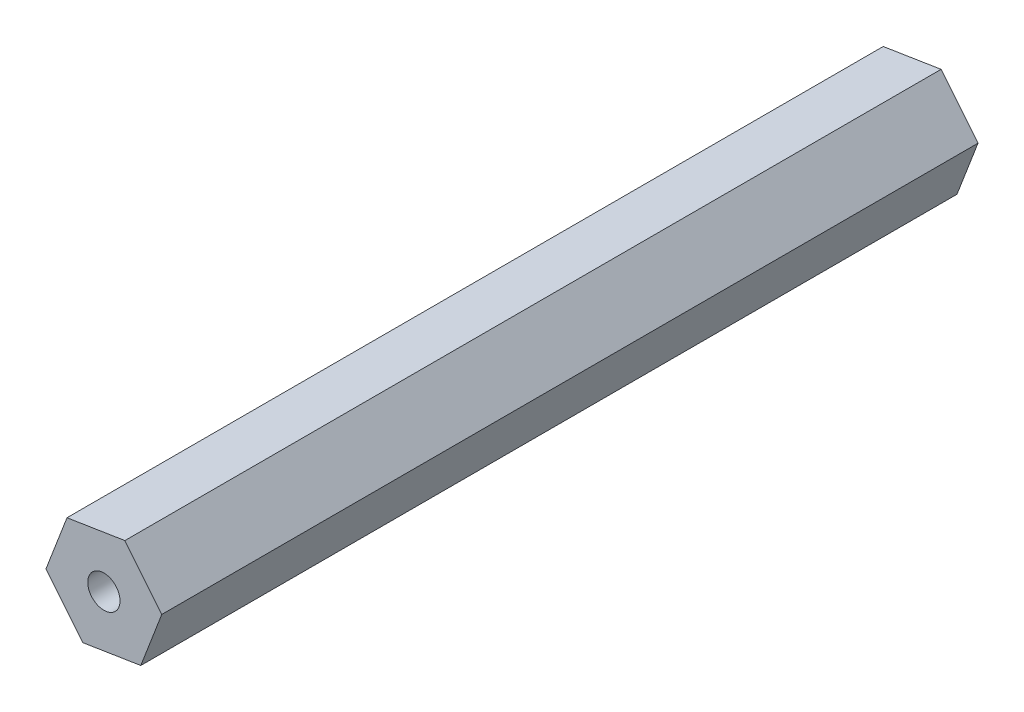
ISO-10303-21;
HEADER;
FILE_DESCRIPTION(('STEP AP214'),'2;1');
FILE_NAME('part.step','',(''),(''),'','','');
FILE_SCHEMA(('AUTOMOTIVE_DESIGN { 1 0 10303 214 1 1 1 1 }'));
ENDSEC;
DATA;
#1=APPLICATION_CONTEXT('core data for automotive mechanical design processes');
#2=APPLICATION_PROTOCOL_DEFINITION('international standard','automotive_design',2000,#1);
#3=PRODUCT_CONTEXT('',#1,'mechanical');
#4=PRODUCT('Part','Part','',(#3));
#5=PRODUCT_RELATED_PRODUCT_CATEGORY('part','',(#4));
#6=PRODUCT_DEFINITION_FORMATION('','',#4);
#7=PRODUCT_DEFINITION_CONTEXT('part definition',#1,'design');
#8=PRODUCT_DEFINITION('design','',#6,#7);
#9=PRODUCT_DEFINITION_SHAPE('','',#8);
#10=(LENGTH_UNIT() NAMED_UNIT(*) SI_UNIT(.MILLI.,.METRE.));
#11=(NAMED_UNIT(*) PLANE_ANGLE_UNIT() SI_UNIT($,.RADIAN.));
#12=(NAMED_UNIT(*) SI_UNIT($,.STERADIAN.) SOLID_ANGLE_UNIT());
#13=UNCERTAINTY_MEASURE_WITH_UNIT(LENGTH_MEASURE(1.E-05),#10,'distance_accuracy_value','');
#14=(GEOMETRIC_REPRESENTATION_CONTEXT(3) GLOBAL_UNCERTAINTY_ASSIGNED_CONTEXT((#13)) GLOBAL_UNIT_ASSIGNED_CONTEXT((#10,
#11,#12)) REPRESENTATION_CONTEXT('',''));
#15=CARTESIAN_POINT('',(0.,0.,0.));
#16=DIRECTION('',(0.,0.,1.));
#17=DIRECTION('',(1.,0.,0.));
#18=AXIS2_PLACEMENT_3D('',#15,#16,#17);
#19=CARTESIAN_POINT('',(7.24192768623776,1.14796198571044,102.108));
#20=DIRECTION('',(-0.777065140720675,-0.629420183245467,0.));
#21=DIRECTION('',(0.629420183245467,-0.777065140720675,0.));
#22=AXIS2_PLACEMENT_3D('',#19,#20,#21);
#23=PLANE('',#22);
#24=DIRECTION('',(-0.629420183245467,0.777065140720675,0.));
#25=VECTOR('',#24,1.);
#26=CARTESIAN_POINT('',(7.24192768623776,1.14796198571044,0.));
#27=LINE('',#26,#25);
#28=CARTESIAN_POINT('',(7.24192768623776,1.14796198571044,0.));
#29=VERTEX_POINT('',#28);
#30=CARTESIAN_POINT('',(2.62679960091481,6.84567434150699,0.));
#31=VERTEX_POINT('',#30);
#32=EDGE_CURVE('E120',#29,#31,#27,.T.);
#33=ORIENTED_EDGE('',*,*,#32,.T.);
#34=DIRECTION('',(0.,0.,-1.));
#35=VECTOR('',#34,1.);
#36=CARTESIAN_POINT('',(2.62679960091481,6.84567434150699,102.108));
#37=LINE('',#36,#35);
#38=CARTESIAN_POINT('',(2.62679960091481,6.84567434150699,102.108));
#39=VERTEX_POINT('',#38);
#40=EDGE_CURVE('E11',#39,#31,#37,.T.);
#41=ORIENTED_EDGE('',*,*,#40,.F.);
#42=DIRECTION('',(-0.629420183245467,0.777065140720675,0.));
#43=VECTOR('',#42,1.);
#44=CARTESIAN_POINT('',(7.24192768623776,1.14796198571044,102.108));
#45=LINE('',#44,#43);
#46=CARTESIAN_POINT('',(7.24192768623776,1.14796198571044,102.108));
#47=VERTEX_POINT('',#46);
#48=EDGE_CURVE('E131',#47,#39,#45,.T.);
#49=ORIENTED_EDGE('',*,*,#48,.F.);
#50=DIRECTION('',(0.,0.,-1.));
#51=VECTOR('',#50,1.);
#52=CARTESIAN_POINT('',(7.24192768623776,1.14796198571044,102.108));
#53=LINE('',#52,#51);
#54=EDGE_CURVE('E116',#47,#29,#53,.T.);
#55=ORIENTED_EDGE('',*,*,#54,.T.);
#56=EDGE_LOOP('',(#33,#41,#49,#55));
#57=FACE_BOUND('',#56,.T.);
#58=ADVANCED_FACE('F33',(#57),#23,.F.);
#59=CARTESIAN_POINT('',(2.62679960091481,6.84567434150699,102.108));
#60=DIRECTION('',(0.156561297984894,-0.987668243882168,0.));
#61=DIRECTION('',(0.987668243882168,0.156561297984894,0.));
#62=AXIS2_PLACEMENT_3D('',#59,#60,#61);
#63=PLANE('',#62);
#64=DIRECTION('',(-0.987668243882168,-0.156561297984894,0.));
#65=VECTOR('',#64,1.);
#66=CARTESIAN_POINT('',(2.62679960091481,6.84567434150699,0.));
#67=LINE('',#66,#65);
#68=CARTESIAN_POINT('',(-4.61512808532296,5.69771235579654,0.));
#69=VERTEX_POINT('',#68);
#70=EDGE_CURVE('E123',#31,#69,#67,.T.);
#71=ORIENTED_EDGE('',*,*,#70,.T.);
#72=DIRECTION('',(0.,0.,-1.));
#73=VECTOR('',#72,1.);
#74=CARTESIAN_POINT('',(-4.61512808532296,5.69771235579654,102.108));
#75=LINE('',#74,#73);
#76=CARTESIAN_POINT('',(-4.61512808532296,5.69771235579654,102.108));
#77=VERTEX_POINT('',#76);
#78=EDGE_CURVE('E41',#77,#69,#75,.T.);
#79=ORIENTED_EDGE('',*,*,#78,.F.);
#80=DIRECTION('',(-0.987668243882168,-0.156561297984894,0.));
#81=VECTOR('',#80,1.);
#82=CARTESIAN_POINT('',(2.62679960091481,6.84567434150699,102.108));
#83=LINE('',#82,#81);
#84=EDGE_CURVE('E87',#39,#77,#83,.T.);
#85=ORIENTED_EDGE('',*,*,#84,.F.);
#86=ORIENTED_EDGE('',*,*,#40,.T.);
#87=EDGE_LOOP('',(#71,#79,#85,#86));
#88=FACE_BOUND('',#87,.T.);
#89=ADVANCED_FACE('F156',(#88),#63,.F.);
#90=CARTESIAN_POINT('',(-4.61512808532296,5.69771235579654,102.108));
#91=DIRECTION('',(0.933626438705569,-0.3582480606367,0.));
#92=DIRECTION('',(0.3582480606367,0.933626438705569,0.));
#93=AXIS2_PLACEMENT_3D('',#90,#91,#92);
#94=PLANE('',#93);
#95=DIRECTION('',(-0.3582480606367,-0.933626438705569,0.));
#96=VECTOR('',#95,1.);
#97=CARTESIAN_POINT('',(-4.61512808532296,5.69771235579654,0.));
#98=LINE('',#97,#96);
#99=CARTESIAN_POINT('',(-7.24192768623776,-1.14796198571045,0.));
#100=VERTEX_POINT('',#99);
#101=EDGE_CURVE('E126',#69,#100,#98,.T.);
#102=ORIENTED_EDGE('',*,*,#101,.T.);
#103=DIRECTION('',(0.,0.,-1.));
#104=VECTOR('',#103,1.);
#105=CARTESIAN_POINT('',(-7.24192768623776,-1.14796198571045,102.108));
#106=LINE('',#105,#104);
#107=CARTESIAN_POINT('',(-7.24192768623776,-1.14796198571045,102.108));
#108=VERTEX_POINT('',#107);
#109=EDGE_CURVE('E111',#108,#100,#106,.T.);
#110=ORIENTED_EDGE('',*,*,#109,.F.);
#111=DIRECTION('',(-0.3582480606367,-0.933626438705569,0.));
#112=VECTOR('',#111,1.);
#113=CARTESIAN_POINT('',(-4.61512808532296,5.69771235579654,102.108));
#114=LINE('',#113,#112);
#115=EDGE_CURVE('E102',#77,#108,#114,.T.);
#116=ORIENTED_EDGE('',*,*,#115,.F.);
#117=ORIENTED_EDGE('',*,*,#78,.T.);
#118=EDGE_LOOP('',(#102,#110,#116,#117));
#119=FACE_BOUND('',#118,.T.);
#120=ADVANCED_FACE('F137',(#119),#94,.F.);
#121=CARTESIAN_POINT('',(-7.24192768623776,-1.14796198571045,102.108));
#122=DIRECTION('',(0.777065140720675,0.629420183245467,0.));
#123=DIRECTION('',(-0.629420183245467,0.777065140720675,0.));
#124=AXIS2_PLACEMENT_3D('',#121,#122,#123);
#125=PLANE('',#124);
#126=DIRECTION('',(0.629420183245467,-0.777065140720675,0.));
#127=VECTOR('',#126,1.);
#128=CARTESIAN_POINT('',(-7.24192768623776,-1.14796198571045,0.));
#129=LINE('',#128,#127);
#130=CARTESIAN_POINT('',(-2.62679960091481,-6.84567434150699,0.));
#131=VERTEX_POINT('',#130);
#132=EDGE_CURVE('E110',#100,#131,#129,.T.);
#133=ORIENTED_EDGE('',*,*,#132,.T.);
#134=DIRECTION('',(0.,0.,-1.));
#135=VECTOR('',#134,1.);
#136=CARTESIAN_POINT('',(-2.62679960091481,-6.84567434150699,102.108));
#137=LINE('',#136,#135);
#138=CARTESIAN_POINT('',(-2.62679960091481,-6.84567434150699,102.108));
#139=VERTEX_POINT('',#138);
#140=EDGE_CURVE('E107',#139,#131,#137,.T.);
#141=ORIENTED_EDGE('',*,*,#140,.F.);
#142=DIRECTION('',(0.629420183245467,-0.777065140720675,0.));
#143=VECTOR('',#142,1.);
#144=CARTESIAN_POINT('',(-7.24192768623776,-1.14796198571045,102.108));
#145=LINE('',#144,#143);
#146=EDGE_CURVE('E96',#108,#139,#145,.T.);
#147=ORIENTED_EDGE('',*,*,#146,.F.);
#148=ORIENTED_EDGE('',*,*,#109,.T.);
#149=EDGE_LOOP('',(#133,#141,#147,#148));
#150=FACE_BOUND('',#149,.T.);
#151=ADVANCED_FACE('F108',(#150),#125,.F.);
#152=CARTESIAN_POINT('',(-2.62679960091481,-6.84567434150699,102.108));
#153=DIRECTION('',(-0.156561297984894,0.987668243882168,0.));
#154=DIRECTION('',(-0.987668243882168,-0.156561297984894,0.));
#155=AXIS2_PLACEMENT_3D('',#152,#153,#154);
#156=PLANE('',#155);
#157=DIRECTION('',(0.987668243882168,0.156561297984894,0.));
#158=VECTOR('',#157,1.);
#159=CARTESIAN_POINT('',(-2.62679960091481,-6.84567434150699,0.));
#160=LINE('',#159,#158);
#161=CARTESIAN_POINT('',(4.61512808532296,-5.69771235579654,0.));
#162=VERTEX_POINT('',#161);
#163=EDGE_CURVE('E73',#131,#162,#160,.T.);
#164=ORIENTED_EDGE('',*,*,#163,.T.);
#165=DIRECTION('',(0.,0.,-1.));
#166=VECTOR('',#165,1.);
#167=CARTESIAN_POINT('',(4.61512808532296,-5.69771235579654,102.108));
#168=LINE('',#167,#166);
#169=CARTESIAN_POINT('',(4.61512808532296,-5.69771235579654,102.108));
#170=VERTEX_POINT('',#169);
#171=EDGE_CURVE('E112',#170,#162,#168,.T.);
#172=ORIENTED_EDGE('',*,*,#171,.F.);
#173=DIRECTION('',(0.987668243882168,0.156561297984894,0.));
#174=VECTOR('',#173,1.);
#175=CARTESIAN_POINT('',(-2.62679960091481,-6.84567434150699,102.108));
#176=LINE('',#175,#174);
#177=EDGE_CURVE('E100',#139,#170,#176,.T.);
#178=ORIENTED_EDGE('',*,*,#177,.F.);
#179=ORIENTED_EDGE('',*,*,#140,.T.);
#180=EDGE_LOOP('',(#164,#172,#178,#179));
#181=FACE_BOUND('',#180,.T.);
#182=ADVANCED_FACE('F114',(#181),#156,.F.);
#183=CARTESIAN_POINT('',(4.61512808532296,-5.69771235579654,102.108));
#184=DIRECTION('',(-0.933626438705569,0.358248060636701,0.));
#185=DIRECTION('',(-0.358248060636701,-0.933626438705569,0.));
#186=AXIS2_PLACEMENT_3D('',#183,#184,#185);
#187=PLANE('',#186);
#188=DIRECTION('',(0.358248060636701,0.933626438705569,0.));
#189=VECTOR('',#188,1.);
#190=CARTESIAN_POINT('',(4.61512808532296,-5.69771235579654,0.));
#191=LINE('',#190,#189);
#192=EDGE_CURVE('E79',#162,#29,#191,.T.);
#193=ORIENTED_EDGE('',*,*,#192,.T.);
#194=ORIENTED_EDGE('',*,*,#54,.F.);
#195=DIRECTION('',(0.358248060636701,0.933626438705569,0.));
#196=VECTOR('',#195,1.);
#197=CARTESIAN_POINT('',(4.61512808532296,-5.69771235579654,102.108));
#198=LINE('',#197,#196);
#199=EDGE_CURVE('E49',#170,#47,#198,.T.);
#200=ORIENTED_EDGE('',*,*,#199,.F.);
#201=ORIENTED_EDGE('',*,*,#171,.T.);
#202=EDGE_LOOP('',(#193,#194,#200,#201));
#203=FACE_BOUND('',#202,.T.);
#204=ADVANCED_FACE('F144',(#203),#187,.F.);
#205=CARTESIAN_POINT('',(0.,0.,102.108));
#206=DIRECTION('',(0.,0.,1.));
#207=DIRECTION('',(1.,0.,0.));
#208=AXIS2_PLACEMENT_3D('',#205,#206,#207);
#209=PLANE('',#208);
#210=CARTESIAN_POINT('',(0.,0.,102.108));
#211=DIRECTION('',(0.,0.,1.));
#212=DIRECTION('',(1.,0.,0.));
#213=AXIS2_PLACEMENT_3D('',#210,#211,#212);
#214=CIRCLE('',#213,2.01929999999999);
#215=CARTESIAN_POINT('',(2.01929999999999,0.,102.108));
#216=VERTEX_POINT('',#215);
#217=EDGE_CURVE('E244',#216,#216,#214,.T.);
#218=ORIENTED_EDGE('',*,*,#217,.F.);
#219=EDGE_LOOP('',(#218));
#220=FACE_BOUND('',#219,.T.);
#221=ORIENTED_EDGE('',*,*,#48,.T.);
#222=ORIENTED_EDGE('',*,*,#84,.T.);
#223=ORIENTED_EDGE('',*,*,#115,.T.);
#224=ORIENTED_EDGE('',*,*,#146,.T.);
#225=ORIENTED_EDGE('',*,*,#177,.T.);
#226=ORIENTED_EDGE('',*,*,#199,.T.);
#227=EDGE_LOOP('',(#221,#222,#223,#224,#225,#226));
#228=FACE_BOUND('',#227,.T.);
#229=ADVANCED_FACE('F98',(#220,#228),#209,.T.);
#230=CARTESIAN_POINT('',(0.,0.,0.));
#231=DIRECTION('',(0.,0.,1.));
#232=DIRECTION('',(1.,0.,0.));
#233=AXIS2_PLACEMENT_3D('',#230,#231,#232);
#234=PLANE('',#233);
#235=CARTESIAN_POINT('',(0.,0.,0.));
#236=DIRECTION('',(0.,0.,-1.));
#237=DIRECTION('',(-1.,0.,0.));
#238=AXIS2_PLACEMENT_3D('',#235,#236,#237);
#239=CIRCLE('',#238,2.01929999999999);
#240=CARTESIAN_POINT('',(-2.01929999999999,0.,0.));
#241=VERTEX_POINT('',#240);
#242=EDGE_CURVE('E242',#241,#241,#239,.T.);
#243=ORIENTED_EDGE('',*,*,#242,.F.);
#244=EDGE_LOOP('',(#243));
#245=FACE_BOUND('',#244,.T.);
#246=ORIENTED_EDGE('',*,*,#32,.F.);
#247=ORIENTED_EDGE('',*,*,#192,.F.);
#248=ORIENTED_EDGE('',*,*,#163,.F.);
#249=ORIENTED_EDGE('',*,*,#132,.F.);
#250=ORIENTED_EDGE('',*,*,#101,.F.);
#251=ORIENTED_EDGE('',*,*,#70,.F.);
#252=EDGE_LOOP('',(#246,#247,#248,#249,#250,#251));
#253=FACE_BOUND('',#252,.T.);
#254=ADVANCED_FACE('F140',(#245,#253),#234,.F.);
#255=CARTESIAN_POINT('',(0.,0.,89.408));
#256=DIRECTION('',(0.,0.,1.));
#257=DIRECTION('',(1.,0.,0.));
#258=AXIS2_PLACEMENT_3D('',#255,#256,#257);
#259=CONICAL_SURFACE('',#258,2.01929999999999,1.02974425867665);
#260=CARTESIAN_POINT('',(0.,0.,88.1946821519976));
#261=VERTEX_POINT('',#260);
#262=VERTEX_LOOP('',#261);
#263=FACE_BOUND('',#262,.T.);
#264=CARTESIAN_POINT('',(0.,0.,89.408));
#265=DIRECTION('',(0.,0.,1.));
#266=DIRECTION('',(1.,0.,0.));
#267=AXIS2_PLACEMENT_3D('',#264,#265,#266);
#268=CIRCLE('',#267,2.01929999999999);
#269=CARTESIAN_POINT('',(2.01929999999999,0.,89.408));
#270=VERTEX_POINT('',#269);
#271=EDGE_CURVE('E124',#270,#270,#268,.T.);
#272=ORIENTED_EDGE('',*,*,#271,.T.);
#273=EDGE_LOOP('',(#272));
#274=FACE_BOUND('',#273,.T.);
#275=ADVANCED_FACE('F191',(#263,#274),#259,.F.);
#276=CARTESIAN_POINT('',(0.,0.,102.108));
#277=DIRECTION('',(0.,0.,1.));
#278=DIRECTION('',(1.,0.,0.));
#279=AXIS2_PLACEMENT_3D('',#276,#277,#278);
#280=CYLINDRICAL_SURFACE('',#279,2.01929999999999);
#281=ORIENTED_EDGE('',*,*,#271,.F.);
#282=EDGE_LOOP('',(#281));
#283=FACE_BOUND('',#282,.T.);
#284=ORIENTED_EDGE('',*,*,#217,.T.);
#285=EDGE_LOOP('',(#284));
#286=FACE_BOUND('',#285,.T.);
#287=ADVANCED_FACE('F196',(#283,#286),#280,.F.);
#288=CARTESIAN_POINT('',(0.,0.,12.7));
#289=DIRECTION('',(0.,0.,-1.));
#290=DIRECTION('',(-1.,0.,0.));
#291=AXIS2_PLACEMENT_3D('',#288,#289,#290);
#292=CONICAL_SURFACE('',#291,2.01929999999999,1.02974425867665);
#293=CARTESIAN_POINT('',(0.,0.,13.9133178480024));
#294=VERTEX_POINT('',#293);
#295=VERTEX_LOOP('',#294);
#296=FACE_BOUND('',#295,.T.);
#297=CARTESIAN_POINT('',(0.,0.,12.7));
#298=DIRECTION('',(0.,0.,-1.));
#299=DIRECTION('',(-1.,0.,0.));
#300=AXIS2_PLACEMENT_3D('',#297,#298,#299);
#301=CIRCLE('',#300,2.01929999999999);
#302=CARTESIAN_POINT('',(-2.01929999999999,0.,12.7));
#303=VERTEX_POINT('',#302);
#304=EDGE_CURVE('E239',#303,#303,#301,.T.);
#305=ORIENTED_EDGE('',*,*,#304,.T.);
#306=EDGE_LOOP('',(#305));
#307=FACE_BOUND('',#306,.T.);
#308=ADVANCED_FACE('F206',(#296,#307),#292,.F.);
#309=CARTESIAN_POINT('',(0.,0.,0.));
#310=DIRECTION('',(0.,0.,-1.));
#311=DIRECTION('',(-1.,0.,0.));
#312=AXIS2_PLACEMENT_3D('',#309,#310,#311);
#313=CYLINDRICAL_SURFACE('',#312,2.01929999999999);
#314=ORIENTED_EDGE('',*,*,#304,.F.);
#315=EDGE_LOOP('',(#314));
#316=FACE_BOUND('',#315,.T.);
#317=ORIENTED_EDGE('',*,*,#242,.T.);
#318=EDGE_LOOP('',(#317));
#319=FACE_BOUND('',#318,.T.);
#320=ADVANCED_FACE('F222',(#316,#319),#313,.F.);
#321=CLOSED_SHELL('',(#58,#89,#120,#151,#182,#204,#229,#254,#275,#287,#308,#320));
#322=MANIFOLD_SOLID_BREP('B2',#321);
#323=ADVANCED_BREP_SHAPE_REPRESENTATION('',(#18,#322),#14);
#324=SHAPE_DEFINITION_REPRESENTATION(#9,#323);
ENDSEC;
END-ISO-10303-21;
